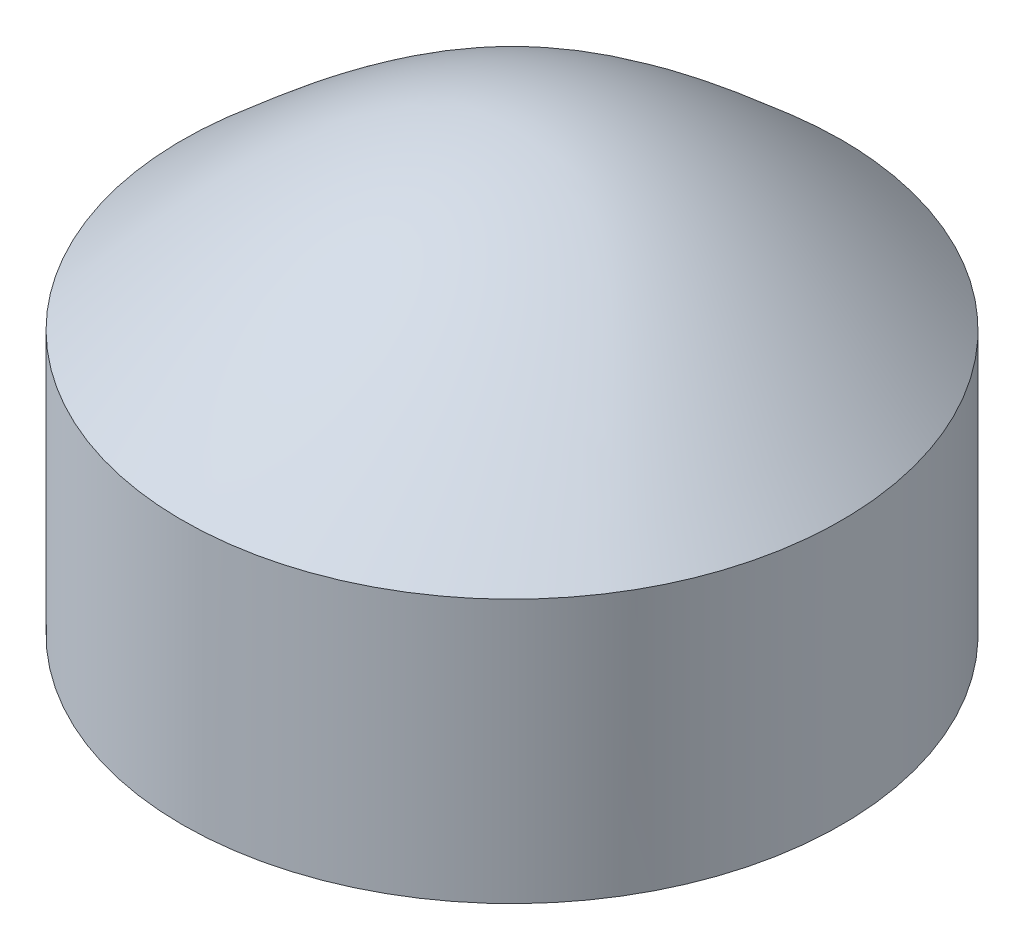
ISO-10303-21;
HEADER;
FILE_DESCRIPTION(('STEP AP214'),'2;1');
FILE_NAME('part.step','',(''),(''),'','','');
FILE_SCHEMA(('AUTOMOTIVE_DESIGN { 1 0 10303 214 1 1 1 1 }'));
ENDSEC;
DATA;
#1=APPLICATION_CONTEXT('core data for automotive mechanical design processes');
#2=APPLICATION_PROTOCOL_DEFINITION('international standard','automotive_design',2000,#1);
#3=PRODUCT_CONTEXT('',#1,'mechanical');
#4=PRODUCT('Part','Part','',(#3));
#5=PRODUCT_RELATED_PRODUCT_CATEGORY('part','',(#4));
#6=PRODUCT_DEFINITION_FORMATION('','',#4);
#7=PRODUCT_DEFINITION_CONTEXT('part definition',#1,'design');
#8=PRODUCT_DEFINITION('design','',#6,#7);
#9=PRODUCT_DEFINITION_SHAPE('','',#8);
#10=(LENGTH_UNIT() NAMED_UNIT(*) SI_UNIT(.MILLI.,.METRE.));
#11=(NAMED_UNIT(*) PLANE_ANGLE_UNIT() SI_UNIT($,.RADIAN.));
#12=(NAMED_UNIT(*) SI_UNIT($,.STERADIAN.) SOLID_ANGLE_UNIT());
#13=UNCERTAINTY_MEASURE_WITH_UNIT(LENGTH_MEASURE(1.E-05),#10,'distance_accuracy_value','');
#14=(GEOMETRIC_REPRESENTATION_CONTEXT(3) GLOBAL_UNCERTAINTY_ASSIGNED_CONTEXT((#13)) GLOBAL_UNIT_ASSIGNED_CONTEXT((#10,
#11,#12)) REPRESENTATION_CONTEXT('',''));
#15=CARTESIAN_POINT('',(0.,0.,0.));
#16=DIRECTION('',(0.,0.,1.));
#17=DIRECTION('',(1.,0.,0.));
#18=AXIS2_PLACEMENT_3D('',#15,#16,#17);
#19=CARTESIAN_POINT('',(0.,60.,0.));
#20=DIRECTION('',(0.,-1.,0.));
#21=DIRECTION('',(0.,0.,-1.));
#22=AXIS2_PLACEMENT_3D('',#19,#20,#21);
#23=CYLINDRICAL_SURFACE('',#22,75.);
#24=CARTESIAN_POINT('',(2.63677968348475E-13,60.0001773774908,-75.));
#25=CARTESIAN_POINT('',(-1.40454979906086,60.0001773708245,-74.9999993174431));
#26=CARTESIAN_POINT('',(-2.80911957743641,60.0001648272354,-74.9605336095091));
#27=CARTESIAN_POINT('',(-5.61420726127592,60.0001175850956,-74.8027715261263));
#28=CARTESIAN_POINT('',(-7.01472392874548,60.000082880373,-74.6844531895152));
#29=CARTESIAN_POINT('',(-9.80700357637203,59.9999995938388,-74.3693273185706));
#30=CARTESIAN_POINT('',(-11.1987659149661,59.9999510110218,-74.1725140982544));
#31=CARTESIAN_POINT('',(-13.9705882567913,59.9998517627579,-73.7007546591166));
#32=CARTESIAN_POINT('',(-15.3506334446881,59.9998010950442,-73.4257213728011));
#33=CARTESIAN_POINT('',(-18.0929706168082,59.9997106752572,-72.7985083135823));
#34=CARTESIAN_POINT('',(-19.4552637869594,59.999670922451,-72.4463337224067));
#35=CARTESIAN_POINT('',(-22.1579020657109,59.9996136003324,-71.665929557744));
#36=CARTESIAN_POINT('',(-23.4982476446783,59.9995960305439,-71.2377016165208));
#37=CARTESIAN_POINT('',(-25.8203765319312,59.9995907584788,-70.423150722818));
#38=CARTESIAN_POINT('',(-26.8079298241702,59.9995966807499,-70.0531704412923));
#39=CARTESIAN_POINT('',(-28.7666432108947,59.9996256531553,-69.2718697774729));
#40=CARTESIAN_POINT('',(-29.7378022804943,59.9996487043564,-68.8605468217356));
#41=CARTESIAN_POINT('',(-31.6618481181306,59.9997108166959,-67.9973463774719));
#42=CARTESIAN_POINT('',(-32.6147360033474,59.9997498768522,-67.5454713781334));
#43=CARTESIAN_POINT('',(-34.5007008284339,59.9998409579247,-66.6019033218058));
#44=CARTESIAN_POINT('',(-35.4337759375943,59.999892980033,-66.1102066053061));
#45=CARTESIAN_POINT('',(-37.2780421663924,60.0000053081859,-65.088084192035));
#46=CARTESIAN_POINT('',(-38.1892407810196,60.0000656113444,-64.5576720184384));
#47=CARTESIAN_POINT('',(-39.9885546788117,60.000188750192,-63.4588593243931));
#48=CARTESIAN_POINT('',(-40.8766677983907,60.000251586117,-62.8904552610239));
#49=CARTESIAN_POINT('',(-42.6280579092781,60.0003735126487,-61.7167707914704));
#50=CARTESIAN_POINT('',(-43.4913373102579,60.0004326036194,-61.111493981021));
#51=CARTESIAN_POINT('',(-45.1916951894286,60.0005409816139,-59.8650316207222));
#52=CARTESIAN_POINT('',(-46.0287712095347,60.0005902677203,-59.2238427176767));
#53=CARTESIAN_POINT('',(-47.6751601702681,60.0006738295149,-57.9067393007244));
#54=CARTESIAN_POINT('',(-48.4844727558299,60.0007081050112,-57.2308243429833));
#55=CARTESIAN_POINT('',(-50.0739591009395,60.0007579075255,-55.8454132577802));
#56=CARTESIAN_POINT('',(-50.8541301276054,60.0007734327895,-55.1359139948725));
#57=CARTESIAN_POINT('',(-52.3837954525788,60.0007838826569,-53.6847215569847));
#58=CARTESIAN_POINT('',(-53.1332925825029,60.0007788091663,-52.9430313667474));
#59=CARTESIAN_POINT('',(-54.6004224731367,60.0007483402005,-51.4286441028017));
#60=CARTESIAN_POINT('',(-55.3180522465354,60.0007229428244,-50.6559441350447));
#61=CARTESIAN_POINT('',(-56.7200591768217,60.0006542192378,-49.0810178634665));
#62=CARTESIAN_POINT('',(-57.4044381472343,60.0006108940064,-48.2787931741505));
#63=CARTESIAN_POINT('',(-58.7388280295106,60.0005105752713,-46.6461335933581));
#64=CARTESIAN_POINT('',(-59.3888357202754,60.0004535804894,-45.8156960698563));
#65=CARTESIAN_POINT('',(-60.6532099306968,60.0003316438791,-44.128215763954));
#66=CARTESIAN_POINT('',(-61.2675797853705,60.000266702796,-43.2711754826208));
#67=CARTESIAN_POINT('',(-62.4596665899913,60.0001353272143,-41.5319406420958));
#68=CARTESIAN_POINT('',(-63.037380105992,60.0000688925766,-40.6497437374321));
#69=CARTESIAN_POINT('',(-64.7138147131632,59.9998776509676,-37.967941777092));
#70=CARTESIAN_POINT('',(-65.7561946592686,59.9997608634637,-36.1326384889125));
#71=CARTESIAN_POINT('',(-67.6824896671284,59.9995931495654,-32.3809917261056));
#72=CARTESIAN_POINT('',(-68.5664047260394,59.9995422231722,-30.4646482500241));
#73=CARTESIAN_POINT('',(-70.1696938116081,59.999522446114,-26.5642476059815));
#74=CARTESIAN_POINT('',(-70.8890681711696,59.9995535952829,-24.5801905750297));
#75=CARTESIAN_POINT('',(-72.1581076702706,59.9996792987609,-20.5585453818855));
#76=CARTESIAN_POINT('',(-72.7077728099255,59.9997738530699,-18.5209572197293));
#77=CARTESIAN_POINT('',(-73.6335020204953,59.9999812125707,-14.4067101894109));
#78=CARTESIAN_POINT('',(-74.0095657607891,60.0000940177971,-12.3300512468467));
#79=CARTESIAN_POINT('',(-74.5854130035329,60.0002860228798,-8.15243605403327));
#80=CARTESIAN_POINT('',(-74.7851965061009,60.0003652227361,-6.05147980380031));
#81=CARTESIAN_POINT('',(-75.0070638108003,60.0004540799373,-1.84020880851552));
#82=CARTESIAN_POINT('',(-75.029147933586,60.0004637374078,0.270105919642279));
#83=CARTESIAN_POINT('',(-74.8954600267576,60.0004091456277,4.48509417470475));
#84=CARTESIAN_POINT('',(-74.739687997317,60.0003448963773,6.58976770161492));
#85=CARTESIAN_POINT('',(-74.2513952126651,60.0001715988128,10.7785115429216));
#86=CARTESIAN_POINT('',(-73.918874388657,60.0000625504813,12.8625818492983));
#87=CARTESIAN_POINT('',(-73.0794479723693,59.999849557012,16.9953019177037));
#88=CARTESIAN_POINT('',(-72.5725423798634,59.9997456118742,19.0439516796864));
#89=CARTESIAN_POINT('',(-71.3879495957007,59.9995917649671,23.0912681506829));
#90=CARTESIAN_POINT('',(-70.7102622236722,59.9995418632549,25.0899348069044));
#91=CARTESIAN_POINT('',(-69.1889241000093,59.9995226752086,29.0230734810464));
#92=CARTESIAN_POINT('',(-68.3452733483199,59.9995533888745,30.9575454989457));
#93=CARTESIAN_POINT('',(-66.4980066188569,59.9996878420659,34.74854134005));
#94=CARTESIAN_POINT('',(-65.4943906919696,59.9997915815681,36.6050651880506));
#95=CARTESIAN_POINT('',(-63.3343285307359,60.0000332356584,40.2269665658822));
#96=CARTESIAN_POINT('',(-62.1778822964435,60.0001711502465,41.9923440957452));
#97=CARTESIAN_POINT('',(-59.7203816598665,60.0004273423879,45.4194013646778));
#98=CARTESIAN_POINT('',(-58.4193273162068,60.0005456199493,47.0810811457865));
#99=CARTESIAN_POINT('',(-55.681859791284,60.0007163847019,50.2889301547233));
#100=CARTESIAN_POINT('',(-54.2454466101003,60.0007688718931,51.8350993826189));
#101=CARTESIAN_POINT('',(-51.2474732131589,60.0007887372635,54.8009351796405));
#102=CARTESIAN_POINT('',(-49.6859129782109,60.0007561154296,56.2206017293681));
#103=CARTESIAN_POINT('',(-46.4487474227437,60.0006208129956,58.9233389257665));
#104=CARTESIAN_POINT('',(-44.7731421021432,60.0005181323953,60.20640957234));
#105=CARTESIAN_POINT('',(-41.3197986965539,60.0002849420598,62.6268332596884));
#106=CARTESIAN_POINT('',(-39.542060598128,60.0001544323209,63.7641862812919));
#107=CARTESIAN_POINT('',(-35.8970904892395,59.9999164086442,65.8850886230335));
#108=CARTESIAN_POINT('',(-34.0298584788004,59.9998088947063,66.8686379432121));
#109=CARTESIAN_POINT('',(-30.2191755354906,59.9996545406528,68.6749403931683));
#110=CARTESIAN_POINT('',(-28.2757246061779,59.9996077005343,69.4976935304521));
#111=CARTESIAN_POINT('',(-24.3264205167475,59.9995838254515,70.9765543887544));
#112=CARTESIAN_POINT('',(-22.3205673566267,59.9996067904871,71.6326621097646));
#113=CARTESIAN_POINT('',(-18.2607193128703,59.9997006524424,72.7735675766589));
#114=CARTESIAN_POINT('',(-16.2067244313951,59.99977154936,73.2583653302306));
#115=CARTESIAN_POINT('',(-12.0651955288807,59.999919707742,74.0532042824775));
#116=CARTESIAN_POINT('',(-9.97766150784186,59.9999969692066,74.3632454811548));
#117=CARTESIAN_POINT('',(-5.78389545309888,60.0001164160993,74.8063671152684));
#118=CARTESIAN_POINT('',(-3.67766341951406,60.0001586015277,74.9394475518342));
#119=CARTESIAN_POINT('',(0.538524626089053,60.0001859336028,75.0277015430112));
#120=CARTESIAN_POINT('',(2.648480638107,60.0001710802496,74.9828750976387));
#121=CARTESIAN_POINT('',(6.85711621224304,60.0000920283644,74.7156340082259));
#122=CARTESIAN_POINT('',(8.95579577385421,60.0000278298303,74.4932193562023));
#123=CARTESIAN_POINT('',(13.1269579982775,59.999883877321,73.8723830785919));
#124=CARTESIAN_POINT('',(15.1994406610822,59.9998041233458,73.4739614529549));
#125=CARTESIAN_POINT('',(19.3034750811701,59.9996732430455,72.5039437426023));
#126=CARTESIAN_POINT('',(21.3350268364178,59.9996221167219,71.9323476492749));
#127=CARTESIAN_POINT('',(25.3427562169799,59.999582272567,70.6200447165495));
#128=CARTESIAN_POINT('',(27.3189338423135,59.9995935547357,69.8793378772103));
#129=CARTESIAN_POINT('',(31.2018652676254,59.999685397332,68.2340795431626));
#130=CARTESIAN_POINT('',(33.1086190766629,59.9997659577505,67.3295280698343));
#131=CARTESIAN_POINT('',(36.8391472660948,59.9999716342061,65.3630112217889));
#132=CARTESIAN_POINT('',(38.6629216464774,60.0000967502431,64.3010458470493));
#133=CARTESIAN_POINT('',(42.2145247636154,60.0003447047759,62.0272513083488));
#134=CARTESIAN_POINT('',(43.9423535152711,60.000467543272,60.8154221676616));
#135=CARTESIAN_POINT('',(47.2897818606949,60.0006616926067,58.2505153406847));
#136=CARTESIAN_POINT('',(48.9093814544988,60.0007330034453,56.8974376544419));
#137=CARTESIAN_POINT('',(52.02883773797,60.0007937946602,54.0596527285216));
#138=CARTESIAN_POINT('',(53.5286943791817,60.0007832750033,52.574945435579));
#139=CARTESIAN_POINT('',(56.3980009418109,60.0006826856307,49.4844571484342));
#140=CARTESIAN_POINT('',(57.7674508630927,60.0005926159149,47.8786761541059));
#141=CARTESIAN_POINT('',(60.3662084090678,60.000367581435,44.5574561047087));
#142=CARTESIAN_POINT('',(61.5955159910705,60.0002326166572,42.8420170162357));
#143=CARTESIAN_POINT('',(63.9052487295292,59.9999706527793,39.313676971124));
#144=CARTESIAN_POINT('',(64.9856738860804,59.9998436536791,37.5007760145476));
#145=CARTESIAN_POINT('',(66.9899595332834,59.9996465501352,33.7904028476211));
#146=CARTESIAN_POINT('',(67.9138201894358,59.9995764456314,31.8929307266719));
#147=CARTESIAN_POINT('',(69.5984101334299,59.9995175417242,28.0269033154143));
#148=CARTESIAN_POINT('',(70.3591394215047,59.9995287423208,26.0583480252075));
#149=CARTESIAN_POINT('',(71.7120580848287,59.9996222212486,22.0641502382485));
#150=CARTESIAN_POINT('',(72.3042475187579,59.999704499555,20.0385077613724));
#151=CARTESIAN_POINT('',(73.3158766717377,59.9999000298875,15.9445358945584));
#152=CARTESIAN_POINT('',(73.7353163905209,60.0000132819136,13.8762065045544));
#153=CARTESIAN_POINT('',(74.3984649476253,60.0002183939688,9.71156207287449));
#154=CARTESIAN_POINT('',(74.6421734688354,60.0003102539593,7.61524698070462));
#155=CARTESIAN_POINT('',(74.952125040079,60.000430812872,3.40953662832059));
#156=CARTESIAN_POINT('',(75.0183680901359,60.0004595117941,1.30014136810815));
#157=CARTESIAN_POINT('',(74.9729205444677,60.0004407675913,-2.91672224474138));
#158=CARTESIAN_POINT('',(74.861230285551,60.0003933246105,-5.02419060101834));
#159=CARTESIAN_POINT('',(74.460700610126,60.0002437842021,-9.22224592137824));
#160=CARTESIAN_POINT('',(74.1718611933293,60.0001416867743,-11.3128328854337));
#161=CARTESIAN_POINT('',(73.4191239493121,59.9999293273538,-15.4621760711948));
#162=CARTESIAN_POINT('',(72.955225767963,59.9998190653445,-17.5209322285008));
#163=CARTESIAN_POINT('',(71.8555271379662,59.9996420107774,-21.5923116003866));
#164=CARTESIAN_POINT('',(71.21972669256,59.9995752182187,-23.6049348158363));
#165=CARTESIAN_POINT('',(70.1407833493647,59.9995321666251,-26.5778755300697));
#166=CARTESIAN_POINT('',(69.7601980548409,59.9995273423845,-27.5613281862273));
#167=CARTESIAN_POINT('',(68.957919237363,59.9995375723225,-29.5112916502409));
#168=CARTESIAN_POINT('',(68.5362295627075,59.9995526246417,-30.4778040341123));
#169=CARTESIAN_POINT('',(67.6524434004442,59.9996017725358,-32.3922632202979));
#170=CARTESIAN_POINT('',(67.1903431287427,59.9996358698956,-33.3402082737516));
#171=CARTESIAN_POINT('',(66.2266303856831,59.9997200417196,-35.2156899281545));
#172=CARTESIAN_POINT('',(65.7250216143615,59.9997701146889,-36.1432284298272));
#173=CARTESIAN_POINT('',(64.6831192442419,59.9998814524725,-37.9763829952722));
#174=CARTESIAN_POINT('',(64.1428235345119,59.9999427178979,-38.8819978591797));
#175=CARTESIAN_POINT('',(63.0245841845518,60.0000703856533,-40.6695603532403));
#176=CARTESIAN_POINT('',(62.4466440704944,60.0001367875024,-41.551510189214));
#177=CARTESIAN_POINT('',(61.2540430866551,60.0002681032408,-43.2903426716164));
#178=CARTESIAN_POINT('',(60.6393788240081,60.0003330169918,-44.1472229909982));
#179=CARTESIAN_POINT('',(59.3745301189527,60.0004548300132,-45.8342287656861));
#180=CARTESIAN_POINT('',(58.7243490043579,60.0005117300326,-46.6643567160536));
#181=CARTESIAN_POINT('',(57.3895785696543,60.0006118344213,-48.2964553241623));
#182=CARTESIAN_POINT('',(56.7049896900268,60.0006550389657,-49.0984263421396));
#183=CARTESIAN_POINT('',(55.3026787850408,60.0007234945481,-50.6727228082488));
#184=CARTESIAN_POINT('',(54.5849598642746,60.0007487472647,-51.4450510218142));
#185=CARTESIAN_POINT('',(53.1175337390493,60.0007789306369,-52.9588419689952));
#186=CARTESIAN_POINT('',(52.3678234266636,60.0007838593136,-53.7003016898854));
#187=CARTESIAN_POINT('',(50.8378842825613,60.000773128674,-55.1508898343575));
#188=CARTESIAN_POINT('',(50.0576583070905,60.0007574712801,-55.8600212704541));
#189=CARTESIAN_POINT('',(48.4677319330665,60.0007074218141,-57.245007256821));
#190=CARTESIAN_POINT('',(47.6580213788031,60.0006730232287,-57.9208501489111));
#191=CARTESIAN_POINT('',(46.0109000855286,60.0005892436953,-59.2377310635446));
#192=CARTESIAN_POINT('',(45.173491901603,60.0005398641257,-59.8787722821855));
#193=CARTESIAN_POINT('',(43.4723344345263,60.0004313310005,-61.1250188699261));
#194=CARTESIAN_POINT('',(42.6085835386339,60.0003721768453,-61.7302220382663));
#195=CARTESIAN_POINT('',(40.8564077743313,60.0002501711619,-62.9036225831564));
#196=CARTESIAN_POINT('',(39.9679844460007,60.000187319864,-63.4718222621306));
#197=CARTESIAN_POINT('',(37.8673672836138,60.0000436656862,-64.7536892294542));
#198=CARTESIAN_POINT('',(36.646115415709,59.9999638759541,-65.4525806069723));
#199=CARTESIAN_POINT('',(34.166255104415,59.9998223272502,-66.7805777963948));
#200=CARTESIAN_POINT('',(32.9076458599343,59.9997605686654,-67.4096821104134));
#201=CARTESIAN_POINT('',(30.3569477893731,59.9996643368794,-68.5961677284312));
#202=CARTESIAN_POINT('',(29.0648567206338,59.9996298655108,-69.1535442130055));
#203=CARTESIAN_POINT('',(26.4528362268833,59.9995916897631,-70.1941711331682));
#204=CARTESIAN_POINT('',(25.1329394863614,59.9995879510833,-70.6775036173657));
#205=CARTESIAN_POINT('',(22.4681784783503,59.9996083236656,-71.5692312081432));
#206=CARTESIAN_POINT('',(21.1233160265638,59.9996324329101,-71.9776317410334));
#207=CARTESIAN_POINT('',(18.413142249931,59.9997001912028,-72.7181472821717));
#208=CARTESIAN_POINT('',(17.0478367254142,59.9997438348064,-73.0502835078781));
#209=CARTESIAN_POINT('',(14.3873162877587,59.9998357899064,-73.618864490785));
#210=CARTESIAN_POINT('',(13.0931056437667,59.9998836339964,-73.8600201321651));
#211=CARTESIAN_POINT('',(10.4940676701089,59.9999754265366,-74.2738559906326));
#212=CARTESIAN_POINT('',(9.18924275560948,60.0000193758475,-74.4465513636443));
#213=CARTESIAN_POINT('',(6.57231482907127,60.0000940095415,-74.7230611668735));
#214=CARTESIAN_POINT('',(5.26021181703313,60.0001246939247,-74.826875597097));
#215=CARTESIAN_POINT('',(2.63207892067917,60.0001663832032,-74.9653529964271));
#216=CARTESIAN_POINT('',(1.31604823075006,60.0001773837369,-75.0000006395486));
#217=CARTESIAN_POINT('',(2.63677968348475E-13,60.0001773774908,-75.));
#218=B_SPLINE_CURVE_WITH_KNOTS('',3,(#24,#25,#26,#27,#28,#29,#30,#31,#32,#33,#34,#35,#36,#37,
#38,#39,#40,#41,#42,#43,#44,#45,#46,#47,#48,#49,#50,#51,#52,#53,#54,#55,#56,#57,#58,#59,#60,#61,
#62,#63,#64,#65,#66,#67,#68,#69,#70,#71,#72,#73,#74,#75,#76,#77,#78,#79,#80,#81,#82,#83,#84,#85,
#86,#87,#88,#89,#90,#91,#92,#93,#94,#95,#96,#97,#98,#99,#100,#101,#102,#103,#104,#105,#106,#107,
#108,#109,#110,#111,#112,#113,#114,#115,#116,#117,#118,#119,#120,#121,#122,#123,#124,#125,#126,
#127,#128,#129,#130,#131,#132,#133,#134,#135,#136,#137,#138,#139,#140,#141,#142,#143,#144,#145,
#146,#147,#148,#149,#150,#151,#152,#153,#154,#155,#156,#157,#158,#159,#160,#161,#162,#163,#164,
#165,#166,#167,#168,#169,#170,#171,#172,#173,#174,#175,#176,#177,#178,#179,#180,#181,#182,#183,
#184,#185,#186,#187,#188,#189,#190,#191,#192,#193,#194,#195,#196,#197,#198,#199,#200,#201,#202,
#203,#204,#205,#206,#207,#208,#209,#210,#211,#212,#213,#214,#215,#216,#217),.UNSPECIFIED.,.T.,
.F.,(4,2,2,2,2,2,2,2,2,2,2,2,2,2,2,2,2,2,2,2,2,2,2,2,2,2,2,2,2,2,2,2,2,2,2,2,2,2,2,2,2,2,2,2,2,
2,2,2,2,2,2,2,2,2,2,2,2,2,2,2,2,2,2,2,2,2,2,2,2,2,2,2,2,2,2,2,2,2,2,2,2,2,2,2,2,2,2,2,2,2,2,2,2,
2,2,2,4),(0.,4.21313027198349,8.427434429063,12.6420439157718,16.8613632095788,21.0803991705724,
25.2993445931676,28.4622153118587,31.6252830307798,34.7881567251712,37.9513214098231,
41.1133864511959,44.2757467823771,47.4377992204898,50.6001474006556,53.7625360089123,
56.9252204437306,60.0876122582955,63.2502998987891,66.412814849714,69.5756256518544,
72.738139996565,75.9009501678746,82.2247509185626,88.5485517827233,94.8723398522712,
101.196127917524,107.519928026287,113.843728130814,120.167516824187,126.491305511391,
132.815096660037,139.138887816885,145.462685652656,151.786483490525,158.110279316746,
164.434075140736,170.757868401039,177.081661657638,183.40545588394,189.729250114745,
196.053045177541,202.376840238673,208.700635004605,215.024429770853,221.348224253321,
227.672018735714,233.995813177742,240.319607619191,246.643402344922,252.96719707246,
259.290992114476,265.614787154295,271.938581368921,278.262375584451,284.586168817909,
290.909962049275,297.233757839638,303.557553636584,309.881351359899,316.205149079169,
322.528940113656,328.852731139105,335.176519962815,341.500308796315,347.824109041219,
354.147909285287,360.471697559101,366.795485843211,373.11928691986,379.443087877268,
382.605898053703,385.768412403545,388.931223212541,392.093738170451,395.256425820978,
398.418817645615,401.581502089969,404.743890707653,407.906238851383,411.068291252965,
414.230651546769,417.392716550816,420.55588119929,423.71875485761,426.881822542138,
430.044693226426,434.26363848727,438.482674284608,442.701993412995,446.91660273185,
451.130906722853,455.344036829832,459.291695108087,463.238478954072,467.185262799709,
471.132921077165),.UNSPECIFIED.);
#219=CARTESIAN_POINT('',(2.63677968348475E-13,60.0001773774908,-75.));
#220=VERTEX_POINT('',#219);
#221=EDGE_CURVE('E12',#220,#220,#218,.T.);
#222=ORIENTED_EDGE('',*,*,#221,.F.);
#223=EDGE_LOOP('',(#222));
#224=FACE_BOUND('',#223,.T.);
#225=CARTESIAN_POINT('',(0.,0.,0.));
#226=DIRECTION('',(0.,1.,0.));
#227=DIRECTION('',(0.,0.,1.));
#228=AXIS2_PLACEMENT_3D('',#225,#226,#227);
#229=CIRCLE('',#228,75.);
#230=CARTESIAN_POINT('',(0.,0.,75.));
#231=VERTEX_POINT('',#230);
#232=EDGE_CURVE('E90',#231,#231,#229,.T.);
#233=ORIENTED_EDGE('',*,*,#232,.T.);
#234=EDGE_LOOP('',(#233));
#235=FACE_BOUND('',#234,.T.);
#236=ADVANCED_FACE('F77',(#224,#235),#23,.T.);
#237=CARTESIAN_POINT('',(77.1105879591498,27.9791717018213,-77.5017601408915));
#238=CARTESIAN_POINT('',(77.1105879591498,48.6325297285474,-46.501055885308));
#239=CARTESIAN_POINT('',(77.1105879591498,65.9169630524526,-15.5003516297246));
#240=CARTESIAN_POINT('',(77.1105879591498,65.916962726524,15.5003526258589));
#241=CARTESIAN_POINT('',(77.1105879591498,48.6325293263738,46.5010568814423));
#242=CARTESIAN_POINT('',(77.1105879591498,27.9791718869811,77.5017611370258));
#243=CARTESIAN_POINT('',(46.2663527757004,48.3500835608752,-77.5017601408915));
#244=CARTESIAN_POINT('',(46.2663527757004,72.1851951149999,-46.501055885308));
#245=CARTESIAN_POINT('',(46.2663527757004,95.5567991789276,-15.5003516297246));
#246=CARTESIAN_POINT('',(46.2663527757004,95.5567882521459,15.5003526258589));
#247=CARTESIAN_POINT('',(46.2663527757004,72.1851975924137,46.5010568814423));
#248=CARTESIAN_POINT('',(46.2663527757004,48.3500829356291,77.5017611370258));
#249=CARTESIAN_POINT('',(15.4221175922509,65.4934645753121,-77.5017601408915));
#250=CARTESIAN_POINT('',(15.4221175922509,95.3734217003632,-46.501055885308));
#251=CARTESIAN_POINT('',(15.4221175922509,124.217054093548,-15.5003516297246));
#252=CARTESIAN_POINT('',(15.4221175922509,124.217084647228,15.5003526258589));
#253=CARTESIAN_POINT('',(15.4221175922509,95.3734079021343,46.5010568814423));
#254=CARTESIAN_POINT('',(15.4221175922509,65.493464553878,77.5017611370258));
#255=CARTESIAN_POINT('',(-15.4221175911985,65.4934656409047,-77.5017601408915));
#256=CARTESIAN_POINT('',(-15.4221175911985,95.3734097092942,-46.501055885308));
#257=CARTESIAN_POINT('',(-15.4221175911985,124.21708601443,-15.5003516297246));
#258=CARTESIAN_POINT('',(-15.4221175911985,124.217052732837,15.5003526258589));
#259=CARTESIAN_POINT('',(-15.4221175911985,95.3734199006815,46.5010568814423));
#260=CARTESIAN_POINT('',(-15.4221175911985,65.4934634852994,77.5017611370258));
#261=CARTESIAN_POINT('',(-46.266352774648,48.3500834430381,-77.5017601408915));
#262=CARTESIAN_POINT('',(-46.266352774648,72.1851987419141,-46.501055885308));
#263=CARTESIAN_POINT('',(-46.266352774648,95.5567892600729,-15.5003516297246));
#264=CARTESIAN_POINT('',(-46.266352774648,95.5567981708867,15.5003526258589));
#265=CARTESIAN_POINT('',(-46.266352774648,72.1851939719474,46.5010568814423));
#266=CARTESIAN_POINT('',(-46.266352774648,48.3500830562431,77.5017611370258));
#267=CARTESIAN_POINT('',(-77.1105879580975,27.9791716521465,-77.5017601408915));
#268=CARTESIAN_POINT('',(-77.1105879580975,48.6325299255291,-46.501055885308));
#269=CARTESIAN_POINT('',(-77.1105879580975,65.9169632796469,-15.5003516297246));
#270=CARTESIAN_POINT('',(-77.1105879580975,65.9169625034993,15.5003526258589));
#271=CARTESIAN_POINT('',(-77.1105879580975,48.6325291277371,46.5010568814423));
#272=CARTESIAN_POINT('',(-77.1105879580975,27.9791719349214,77.5017611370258));
#273=B_SPLINE_SURFACE_WITH_KNOTS('',5,5,((#237,#238,#239,#240,#241,#242),(#243,#244,#245,#246,
#247,#248),(#249,#250,#251,#252,#253,#254),(#255,#256,#257,#258,#259,#260),(#261,#262,#263,#264,
#265,#266),(#267,#268,#269,#270,#271,#272)),.UNSPECIFIED.,.F.,.F.,.F.,(6,6),(6,6),
(-77.1105879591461,77.1105879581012),(-77.5017601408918,77.5017611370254),.UNSPECIFIED.);
#274=ORIENTED_EDGE('',*,*,#221,.T.);
#275=EDGE_LOOP('',(#274));
#276=FACE_BOUND('',#275,.T.);
#277=ADVANCED_FACE('F79',(#276),#273,.T.);
#278=CARTESIAN_POINT('',(0.,0.,0.));
#279=DIRECTION('',(0.,1.,0.));
#280=DIRECTION('',(0.,0.,1.));
#281=AXIS2_PLACEMENT_3D('',#278,#279,#280);
#282=PLANE('',#281);
#283=ORIENTED_EDGE('',*,*,#232,.F.);
#284=EDGE_LOOP('',(#283));
#285=FACE_BOUND('',#284,.T.);
#286=ADVANCED_FACE('F97',(#285),#282,.F.);
#287=CLOSED_SHELL('',(#236,#277,#286));
#288=MANIFOLD_SOLID_BREP('B2',#287);
#289=ADVANCED_BREP_SHAPE_REPRESENTATION('',(#18,#288),#14);
#290=SHAPE_DEFINITION_REPRESENTATION(#9,#289);
ENDSEC;
END-ISO-10303-21;
